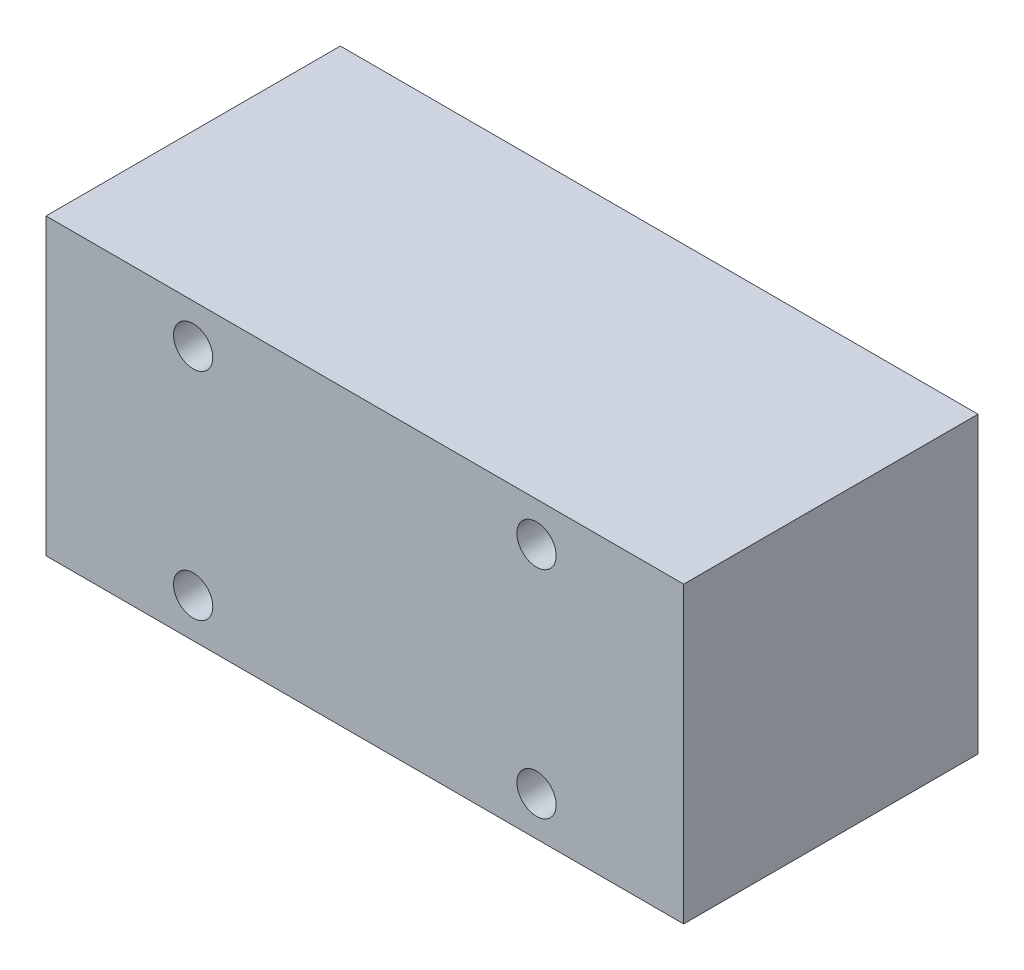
from build123d import *

# Parameters (mm, degrees)
ESQUISSE1_W      = 65
ESQUISSE1_H      = 30
EXTRUSION1_DEPTH = 30
ESQUISSE2_R      = 2
EXTRUSION2_DEPTH = 10
ESQUISSE3_R      = 3
EXTRUSION3_DEPTH = 10


with BuildPart() as part:
    # Esquisse1 → Extrusion1 (new body)
    with BuildSketch(Plane.XY):
        with Locations((-32.5, 15)):
            Rectangle(ESQUISSE1_W, ESQUISSE1_H)
    extrude(amount=EXTRUSION1_DEPTH)

    # Esquisse2 → Extrusion2 (cut)
    with BuildSketch(Plane.XY.offset(30)):
        with Locations((-50, 26)):
            Circle(ESQUISSE2_R)
        with Locations((-50, 4)):
            Circle(ESQUISSE2_R)
        with Locations((-15, 4)):
            Circle(ESQUISSE2_R)
        with Locations((-15, 26)):
            Circle(ESQUISSE2_R)
    extrude(amount=-EXTRUSION2_DEPTH, mode=Mode.SUBTRACT)

    # Esquisse3 → Extrusion3 (add)
    with BuildSketch(Plane.ZY.offset(65)):
        with Locations(Location((15, 15, 0), (0, 0, 180))):
            Circle(ESQUISSE3_R)
    extrude(amount=EXTRUSION3_DEPTH)


solid = part.part
